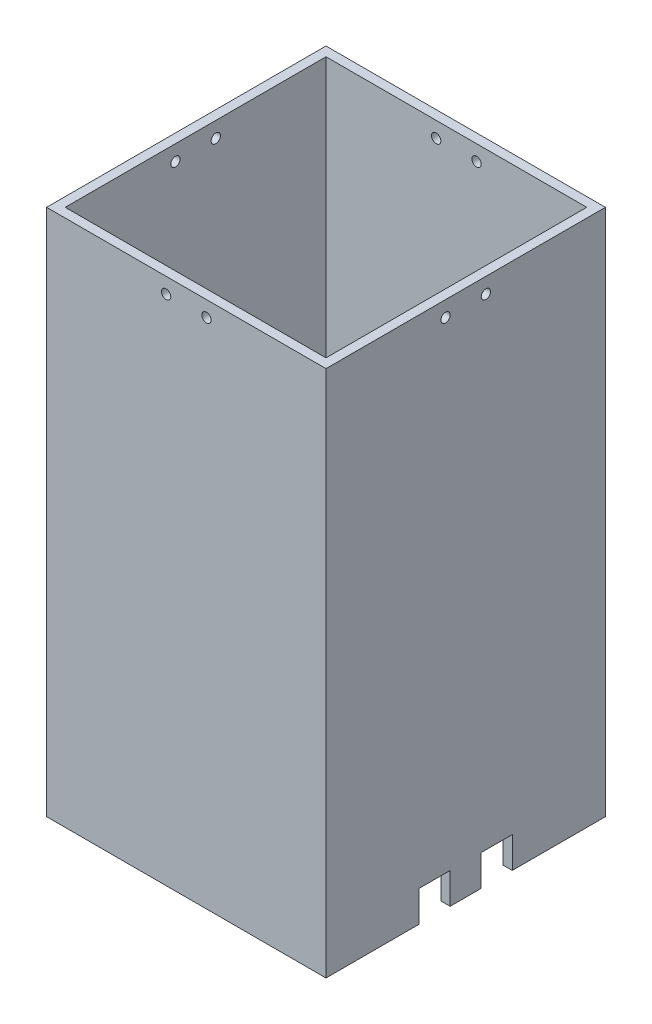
ISO-10303-21;
HEADER;
FILE_DESCRIPTION(('STEP AP214'),'2;1');
FILE_NAME('part.step','',(''),(''),'','','');
FILE_SCHEMA(('AUTOMOTIVE_DESIGN { 1 0 10303 214 1 1 1 1 }'));
ENDSEC;
DATA;
#1=APPLICATION_CONTEXT('core data for automotive mechanical design processes');
#2=APPLICATION_PROTOCOL_DEFINITION('international standard','automotive_design',2000,#1);
#3=PRODUCT_CONTEXT('',#1,'mechanical');
#4=PRODUCT('Part','Part','',(#3));
#5=PRODUCT_RELATED_PRODUCT_CATEGORY('part','',(#4));
#6=PRODUCT_DEFINITION_FORMATION('','',#4);
#7=PRODUCT_DEFINITION_CONTEXT('part definition',#1,'design');
#8=PRODUCT_DEFINITION('design','',#6,#7);
#9=PRODUCT_DEFINITION_SHAPE('','',#8);
#10=(LENGTH_UNIT() NAMED_UNIT(*) SI_UNIT(.MILLI.,.METRE.));
#11=(NAMED_UNIT(*) PLANE_ANGLE_UNIT() SI_UNIT($,.RADIAN.));
#12=(NAMED_UNIT(*) SI_UNIT($,.STERADIAN.) SOLID_ANGLE_UNIT());
#13=UNCERTAINTY_MEASURE_WITH_UNIT(LENGTH_MEASURE(1.E-05),#10,'distance_accuracy_value','');
#14=(GEOMETRIC_REPRESENTATION_CONTEXT(3) GLOBAL_UNCERTAINTY_ASSIGNED_CONTEXT((#13)) GLOBAL_UNIT_ASSIGNED_CONTEXT((#10,
#11,#12)) REPRESENTATION_CONTEXT('',''));
#15=CARTESIAN_POINT('',(0.,0.,0.));
#16=DIRECTION('',(0.,0.,1.));
#17=DIRECTION('',(1.,0.,0.));
#18=AXIS2_PLACEMENT_3D('',#15,#16,#17);
#19=CARTESIAN_POINT('',(0.,0.,0.));
#20=DIRECTION('',(0.,-1.,0.));
#21=DIRECTION('',(0.,0.,-1.));
#22=AXIS2_PLACEMENT_3D('',#19,#20,#21);
#23=PLANE('',#22);
#24=DIRECTION('',(1.,0.,0.));
#25=VECTOR('',#24,1.);
#26=CARTESIAN_POINT('',(-59.1421356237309,0.,15.));
#27=LINE('',#26,#25);
#28=CARTESIAN_POINT('',(42.,0.,15.));
#29=VERTEX_POINT('',#28);
#30=CARTESIAN_POINT('',(45.,0.,15.));
#31=VERTEX_POINT('',#30);
#32=EDGE_CURVE('E195',#29,#31,#27,.T.);
#33=ORIENTED_EDGE('',*,*,#32,.T.);
#34=DIRECTION('',(0.,0.,-1.));
#35=VECTOR('',#34,1.);
#36=CARTESIAN_POINT('',(45.,0.,45.));
#37=LINE('',#36,#35);
#38=CARTESIAN_POINT('',(45.,0.,45.));
#39=VERTEX_POINT('',#38);
#40=EDGE_CURVE('E209',#39,#31,#37,.T.);
#41=ORIENTED_EDGE('',*,*,#40,.F.);
#42=DIRECTION('',(1.,0.,0.));
#43=VECTOR('',#42,1.);
#44=CARTESIAN_POINT('',(-45.,0.,45.));
#45=LINE('',#44,#43);
#46=CARTESIAN_POINT('',(-45.,0.,45.));
#47=VERTEX_POINT('',#46);
#48=EDGE_CURVE('E248',#47,#39,#45,.T.);
#49=ORIENTED_EDGE('',*,*,#48,.F.);
#50=DIRECTION('',(0.,0.,1.));
#51=VECTOR('',#50,1.);
#52=CARTESIAN_POINT('',(-45.,0.,45.));
#53=LINE('',#52,#51);
#54=CARTESIAN_POINT('',(-45.,0.,15.));
#55=VERTEX_POINT('',#54);
#56=EDGE_CURVE('E224',#55,#47,#53,.T.);
#57=ORIENTED_EDGE('',*,*,#56,.F.);
#58=CARTESIAN_POINT('',(-42.,0.,15.));
#59=VERTEX_POINT('',#58);
#60=EDGE_CURVE('E213',#55,#59,#27,.T.);
#61=ORIENTED_EDGE('',*,*,#60,.T.);
#62=DIRECTION('',(0.,0.,1.));
#63=VECTOR('',#62,1.);
#64=CARTESIAN_POINT('',(-42.,0.,-42.));
#65=LINE('',#64,#63);
#66=CARTESIAN_POINT('',(-42.,0.,42.));
#67=VERTEX_POINT('',#66);
#68=EDGE_CURVE('E403',#59,#67,#65,.T.);
#69=ORIENTED_EDGE('',*,*,#68,.T.);
#70=DIRECTION('',(1.,0.,0.));
#71=VECTOR('',#70,1.);
#72=CARTESIAN_POINT('',(-42.,0.,42.));
#73=LINE('',#72,#71);
#74=CARTESIAN_POINT('',(42.,0.,42.));
#75=VERTEX_POINT('',#74);
#76=EDGE_CURVE('E407',#67,#75,#73,.T.);
#77=ORIENTED_EDGE('',*,*,#76,.T.);
#78=DIRECTION('',(0.,0.,-1.));
#79=VECTOR('',#78,1.);
#80=CARTESIAN_POINT('',(42.,0.,42.));
#81=LINE('',#80,#79);
#82=EDGE_CURVE('E212',#75,#29,#81,.T.);
#83=ORIENTED_EDGE('',*,*,#82,.T.);
#84=EDGE_LOOP('',(#33,#41,#49,#57,#61,#69,#77,#83));
#85=FACE_BOUND('',#84,.T.);
#86=ADVANCED_FACE('F33',(#85),#23,.T.);
#87=DIRECTION('',(1.,0.,0.));
#88=VECTOR('',#87,1.);
#89=CARTESIAN_POINT('',(-59.1421356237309,0.,5.00000000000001));
#90=LINE('',#89,#88);
#91=CARTESIAN_POINT('',(-45.,0.,5.00000000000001));
#92=VERTEX_POINT('',#91);
#93=CARTESIAN_POINT('',(-42.,0.,5.00000000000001));
#94=VERTEX_POINT('',#93);
#95=EDGE_CURVE('E48',#92,#94,#90,.T.);
#96=ORIENTED_EDGE('',*,*,#95,.F.);
#97=CARTESIAN_POINT('',(-45.,0.,-5.));
#98=VERTEX_POINT('',#97);
#99=EDGE_CURVE('E471',#98,#92,#53,.T.);
#100=ORIENTED_EDGE('',*,*,#99,.F.);
#101=DIRECTION('',(1.,0.,0.));
#102=VECTOR('',#101,1.);
#103=CARTESIAN_POINT('',(-59.1421356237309,0.,-5.));
#104=LINE('',#103,#102);
#105=CARTESIAN_POINT('',(-42.,0.,-5.));
#106=VERTEX_POINT('',#105);
#107=EDGE_CURVE('E355',#98,#106,#104,.T.);
#108=ORIENTED_EDGE('',*,*,#107,.T.);
#109=EDGE_CURVE('E408',#106,#94,#65,.T.);
#110=ORIENTED_EDGE('',*,*,#109,.T.);
#111=EDGE_LOOP('',(#96,#100,#108,#110));
#112=FACE_BOUND('',#111,.T.);
#113=ADVANCED_FACE('F498',(#112),#23,.T.);
#114=CARTESIAN_POINT('',(42.,0.,5.00000000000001));
#115=VERTEX_POINT('',#114);
#116=CARTESIAN_POINT('',(45.,0.,5.00000000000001));
#117=VERTEX_POINT('',#116);
#118=EDGE_CURVE('E307',#115,#117,#90,.T.);
#119=ORIENTED_EDGE('',*,*,#118,.F.);
#120=CARTESIAN_POINT('',(42.,0.,-5.));
#121=VERTEX_POINT('',#120);
#122=EDGE_CURVE('E304',#115,#121,#81,.T.);
#123=ORIENTED_EDGE('',*,*,#122,.T.);
#124=CARTESIAN_POINT('',(45.,0.,-5.));
#125=VERTEX_POINT('',#124);
#126=EDGE_CURVE('E344',#121,#125,#104,.T.);
#127=ORIENTED_EDGE('',*,*,#126,.T.);
#128=EDGE_CURVE('E221',#117,#125,#37,.T.);
#129=ORIENTED_EDGE('',*,*,#128,.F.);
#130=EDGE_LOOP('',(#119,#123,#127,#129));
#131=FACE_BOUND('',#130,.T.);
#132=ADVANCED_FACE('F311',(#131),#23,.T.);
#133=CARTESIAN_POINT('',(0.,170.,0.));
#134=DIRECTION('',(0.,-1.,0.));
#135=DIRECTION('',(0.,0.,-1.));
#136=AXIS2_PLACEMENT_3D('',#133,#134,#135);
#137=PLANE('',#136);
#138=DIRECTION('',(0.,0.,-1.));
#139=VECTOR('',#138,1.);
#140=CARTESIAN_POINT('',(45.,170.,45.));
#141=LINE('',#140,#139);
#142=CARTESIAN_POINT('',(45.,170.,45.));
#143=VERTEX_POINT('',#142);
#144=CARTESIAN_POINT('',(45.,170.,-45.));
#145=VERTEX_POINT('',#144);
#146=EDGE_CURVE('E244',#143,#145,#141,.T.);
#147=ORIENTED_EDGE('',*,*,#146,.T.);
#148=DIRECTION('',(-1.,0.,0.));
#149=VECTOR('',#148,1.);
#150=CARTESIAN_POINT('',(-45.,170.,-45.));
#151=LINE('',#150,#149);
#152=CARTESIAN_POINT('',(-45.,170.,-45.));
#153=VERTEX_POINT('',#152);
#154=EDGE_CURVE('E247',#145,#153,#151,.T.);
#155=ORIENTED_EDGE('',*,*,#154,.T.);
#156=DIRECTION('',(0.,0.,1.));
#157=VECTOR('',#156,1.);
#158=CARTESIAN_POINT('',(-45.,170.,45.));
#159=LINE('',#158,#157);
#160=CARTESIAN_POINT('',(-45.,170.,45.));
#161=VERTEX_POINT('',#160);
#162=EDGE_CURVE('E250',#153,#161,#159,.T.);
#163=ORIENTED_EDGE('',*,*,#162,.T.);
#164=DIRECTION('',(1.,0.,0.));
#165=VECTOR('',#164,1.);
#166=CARTESIAN_POINT('',(-45.,170.,45.));
#167=LINE('',#166,#165);
#168=EDGE_CURVE('E251',#161,#143,#167,.T.);
#169=ORIENTED_EDGE('',*,*,#168,.T.);
#170=EDGE_LOOP('',(#147,#155,#163,#169));
#171=FACE_BOUND('',#170,.T.);
#172=DIRECTION('',(-1.,0.,0.));
#173=VECTOR('',#172,1.);
#174=CARTESIAN_POINT('',(42.,170.,-42.));
#175=LINE('',#174,#173);
#176=CARTESIAN_POINT('',(42.,170.,-42.));
#177=VERTEX_POINT('',#176);
#178=CARTESIAN_POINT('',(-42.,170.,-42.));
#179=VERTEX_POINT('',#178);
#180=EDGE_CURVE('E392',#177,#179,#175,.T.);
#181=ORIENTED_EDGE('',*,*,#180,.F.);
#182=DIRECTION('',(0.,0.,-1.));
#183=VECTOR('',#182,1.);
#184=CARTESIAN_POINT('',(42.,170.,42.));
#185=LINE('',#184,#183);
#186=CARTESIAN_POINT('',(42.,170.,42.));
#187=VERTEX_POINT('',#186);
#188=EDGE_CURVE('E399',#187,#177,#185,.T.);
#189=ORIENTED_EDGE('',*,*,#188,.F.);
#190=DIRECTION('',(1.,0.,0.));
#191=VECTOR('',#190,1.);
#192=CARTESIAN_POINT('',(-42.,170.,42.));
#193=LINE('',#192,#191);
#194=CARTESIAN_POINT('',(-42.,170.,42.));
#195=VERTEX_POINT('',#194);
#196=EDGE_CURVE('E396',#195,#187,#193,.T.);
#197=ORIENTED_EDGE('',*,*,#196,.F.);
#198=DIRECTION('',(0.,0.,1.));
#199=VECTOR('',#198,1.);
#200=CARTESIAN_POINT('',(-42.,170.,-42.));
#201=LINE('',#200,#199);
#202=EDGE_CURVE('E394',#179,#195,#201,.T.);
#203=ORIENTED_EDGE('',*,*,#202,.F.);
#204=EDGE_LOOP('',(#181,#189,#197,#203));
#205=FACE_BOUND('',#204,.T.);
#206=ADVANCED_FACE('F428',(#171,#205),#137,.F.);
#207=DIRECTION('',(1.,0.,0.));
#208=VECTOR('',#207,1.);
#209=CARTESIAN_POINT('',(-59.1421356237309,0.,-15.));
#210=LINE('',#209,#208);
#211=CARTESIAN_POINT('',(-45.,0.,-15.));
#212=VERTEX_POINT('',#211);
#213=CARTESIAN_POINT('',(-42.,0.,-15.));
#214=VERTEX_POINT('',#213);
#215=EDGE_CURVE('E352',#212,#214,#210,.T.);
#216=ORIENTED_EDGE('',*,*,#215,.F.);
#217=CARTESIAN_POINT('',(-45.,0.,-45.));
#218=VERTEX_POINT('',#217);
#219=EDGE_CURVE('E472',#218,#212,#53,.T.);
#220=ORIENTED_EDGE('',*,*,#219,.F.);
#221=DIRECTION('',(-1.,0.,0.));
#222=VECTOR('',#221,1.);
#223=CARTESIAN_POINT('',(-45.,0.,-45.));
#224=LINE('',#223,#222);
#225=CARTESIAN_POINT('',(45.,0.,-45.));
#226=VERTEX_POINT('',#225);
#227=EDGE_CURVE('E220',#226,#218,#224,.T.);
#228=ORIENTED_EDGE('',*,*,#227,.F.);
#229=CARTESIAN_POINT('',(45.,0.,-15.));
#230=VERTEX_POINT('',#229);
#231=EDGE_CURVE('E223',#230,#226,#37,.T.);
#232=ORIENTED_EDGE('',*,*,#231,.F.);
#233=CARTESIAN_POINT('',(42.,0.,-15.));
#234=VERTEX_POINT('',#233);
#235=EDGE_CURVE('E354',#234,#230,#210,.T.);
#236=ORIENTED_EDGE('',*,*,#235,.F.);
#237=CARTESIAN_POINT('',(42.,0.,-42.));
#238=VERTEX_POINT('',#237);
#239=EDGE_CURVE('E410',#234,#238,#81,.T.);
#240=ORIENTED_EDGE('',*,*,#239,.T.);
#241=DIRECTION('',(-1.,0.,0.));
#242=VECTOR('',#241,1.);
#243=CARTESIAN_POINT('',(42.,0.,-42.));
#244=LINE('',#243,#242);
#245=CARTESIAN_POINT('',(-42.,0.,-42.));
#246=VERTEX_POINT('',#245);
#247=EDGE_CURVE('E391',#238,#246,#244,.T.);
#248=ORIENTED_EDGE('',*,*,#247,.T.);
#249=EDGE_CURVE('E404',#246,#214,#65,.T.);
#250=ORIENTED_EDGE('',*,*,#249,.T.);
#251=EDGE_LOOP('',(#216,#220,#228,#232,#236,#240,#248,#250));
#252=FACE_BOUND('',#251,.T.);
#253=ADVANCED_FACE('F434',(#252),#23,.T.);
#254=CARTESIAN_POINT('',(45.,170.,45.));
#255=DIRECTION('',(-1.,0.,0.));
#256=DIRECTION('',(0.,0.,1.));
#257=AXIS2_PLACEMENT_3D('',#254,#255,#256);
#258=PLANE('',#257);
#259=CARTESIAN_POINT('',(45.,165.,6.49999999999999));
#260=DIRECTION('',(1.,0.,0.));
#261=DIRECTION('',(0.,0.,-1.));
#262=AXIS2_PLACEMENT_3D('',#259,#260,#261);
#263=CIRCLE('',#262,1.5);
#264=CARTESIAN_POINT('',(45.,165.,4.99999999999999));
#265=VERTEX_POINT('',#264);
#266=EDGE_CURVE('E363',#265,#265,#263,.T.);
#267=ORIENTED_EDGE('',*,*,#266,.F.);
#268=EDGE_LOOP('',(#267));
#269=FACE_BOUND('',#268,.T.);
#270=CARTESIAN_POINT('',(45.,165.,-6.50000000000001));
#271=DIRECTION('',(1.,0.,0.));
#272=DIRECTION('',(0.,0.,-1.));
#273=AXIS2_PLACEMENT_3D('',#270,#271,#272);
#274=CIRCLE('',#273,1.5);
#275=CARTESIAN_POINT('',(45.,165.,-8.00000000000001));
#276=VERTEX_POINT('',#275);
#277=EDGE_CURVE('E370',#276,#276,#274,.T.);
#278=ORIENTED_EDGE('',*,*,#277,.F.);
#279=EDGE_LOOP('',(#278));
#280=FACE_BOUND('',#279,.T.);
#281=ORIENTED_EDGE('',*,*,#40,.T.);
#282=DIRECTION('',(0.,-1.,0.));
#283=VECTOR('',#282,1.);
#284=CARTESIAN_POINT('',(45.,0.,15.));
#285=LINE('',#284,#283);
#286=CARTESIAN_POINT('',(45.,10.,15.));
#287=VERTEX_POINT('',#286);
#288=EDGE_CURVE('E192',#287,#31,#285,.T.);
#289=ORIENTED_EDGE('',*,*,#288,.F.);
#290=DIRECTION('',(0.,0.,1.));
#291=VECTOR('',#290,1.);
#292=CARTESIAN_POINT('',(45.,10.,15.));
#293=LINE('',#292,#291);
#294=CARTESIAN_POINT('',(45.,10.,5.00000000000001));
#295=VERTEX_POINT('',#294);
#296=EDGE_CURVE('E214',#295,#287,#293,.T.);
#297=ORIENTED_EDGE('',*,*,#296,.F.);
#298=DIRECTION('',(0.,1.,0.));
#299=VECTOR('',#298,1.);
#300=CARTESIAN_POINT('',(45.,0.,5.00000000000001));
#301=LINE('',#300,#299);
#302=EDGE_CURVE('E203',#117,#295,#301,.T.);
#303=ORIENTED_EDGE('',*,*,#302,.F.);
#304=ORIENTED_EDGE('',*,*,#128,.T.);
#305=DIRECTION('',(0.,-1.,0.));
#306=VECTOR('',#305,1.);
#307=CARTESIAN_POINT('',(45.,0.,-5.));
#308=LINE('',#307,#306);
#309=CARTESIAN_POINT('',(45.,10.,-5.));
#310=VERTEX_POINT('',#309);
#311=EDGE_CURVE('E327',#310,#125,#308,.T.);
#312=ORIENTED_EDGE('',*,*,#311,.F.);
#313=DIRECTION('',(0.,0.,1.));
#314=VECTOR('',#313,1.);
#315=CARTESIAN_POINT('',(45.,10.,-5.));
#316=LINE('',#315,#314);
#317=CARTESIAN_POINT('',(45.,10.,-15.));
#318=VERTEX_POINT('',#317);
#319=EDGE_CURVE('E341',#318,#310,#316,.T.);
#320=ORIENTED_EDGE('',*,*,#319,.F.);
#321=DIRECTION('',(0.,1.,0.));
#322=VECTOR('',#321,1.);
#323=CARTESIAN_POINT('',(45.,0.,-15.));
#324=LINE('',#323,#322);
#325=EDGE_CURVE('E338',#230,#318,#324,.T.);
#326=ORIENTED_EDGE('',*,*,#325,.F.);
#327=ORIENTED_EDGE('',*,*,#231,.T.);
#328=DIRECTION('',(0.,-1.,0.));
#329=VECTOR('',#328,1.);
#330=CARTESIAN_POINT('',(45.,170.,-45.));
#331=LINE('',#330,#329);
#332=EDGE_CURVE('E264',#145,#226,#331,.T.);
#333=ORIENTED_EDGE('',*,*,#332,.F.);
#334=ORIENTED_EDGE('',*,*,#146,.F.);
#335=DIRECTION('',(0.,-1.,0.));
#336=VECTOR('',#335,1.);
#337=CARTESIAN_POINT('',(45.,170.,45.));
#338=LINE('',#337,#336);
#339=EDGE_CURVE('E219',#143,#39,#338,.T.);
#340=ORIENTED_EDGE('',*,*,#339,.T.);
#341=EDGE_LOOP('',(#281,#289,#297,#303,#304,#312,#320,#326,#327,#333,#334,#340));
#342=FACE_BOUND('',#341,.T.);
#343=ADVANCED_FACE('F35',(#269,#280,#342),#258,.F.);
#344=CARTESIAN_POINT('',(-45.,170.,-45.));
#345=DIRECTION('',(0.,0.,1.));
#346=DIRECTION('',(1.,0.,0.));
#347=AXIS2_PLACEMENT_3D('',#344,#345,#346);
#348=PLANE('',#347);
#349=CARTESIAN_POINT('',(-6.49999999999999,165.,-45.));
#350=DIRECTION('',(0.,0.,1.));
#351=DIRECTION('',(1.,0.,0.));
#352=AXIS2_PLACEMENT_3D('',#349,#350,#351);
#353=CIRCLE('',#352,1.50000000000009);
#354=CARTESIAN_POINT('',(-4.9999999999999,165.,-45.));
#355=VERTEX_POINT('',#354);
#356=EDGE_CURVE('E277',#355,#355,#353,.F.);
#357=ORIENTED_EDGE('',*,*,#356,.F.);
#358=EDGE_LOOP('',(#357));
#359=FACE_BOUND('',#358,.T.);
#360=CARTESIAN_POINT('',(6.50000000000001,165.,-45.));
#361=DIRECTION('',(0.,0.,1.));
#362=DIRECTION('',(1.,0.,0.));
#363=AXIS2_PLACEMENT_3D('',#360,#361,#362);
#364=CIRCLE('',#363,1.50000000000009);
#365=CARTESIAN_POINT('',(8.00000000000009,165.,-45.));
#366=VERTEX_POINT('',#365);
#367=EDGE_CURVE('E272',#366,#366,#364,.F.);
#368=ORIENTED_EDGE('',*,*,#367,.F.);
#369=EDGE_LOOP('',(#368));
#370=FACE_BOUND('',#369,.T.);
#371=ORIENTED_EDGE('',*,*,#227,.T.);
#372=DIRECTION('',(0.,-1.,0.));
#373=VECTOR('',#372,1.);
#374=CARTESIAN_POINT('',(-45.,170.,-45.));
#375=LINE('',#374,#373);
#376=EDGE_CURVE('E257',#153,#218,#375,.T.);
#377=ORIENTED_EDGE('',*,*,#376,.F.);
#378=ORIENTED_EDGE('',*,*,#154,.F.);
#379=ORIENTED_EDGE('',*,*,#332,.T.);
#380=EDGE_LOOP('',(#371,#377,#378,#379));
#381=FACE_BOUND('',#380,.T.);
#382=ADVANCED_FACE('F482',(#359,#370,#381),#348,.F.);
#383=CARTESIAN_POINT('',(-45.,170.,45.));
#384=DIRECTION('',(1.,0.,0.));
#385=DIRECTION('',(0.,0.,-1.));
#386=AXIS2_PLACEMENT_3D('',#383,#384,#385);
#387=PLANE('',#386);
#388=CARTESIAN_POINT('',(-45.,165.,6.49999999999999));
#389=DIRECTION('',(1.,0.,0.));
#390=DIRECTION('',(0.,0.,-1.));
#391=AXIS2_PLACEMENT_3D('',#388,#389,#390);
#392=CIRCLE('',#391,1.5);
#393=CARTESIAN_POINT('',(-45.,165.,4.99999999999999));
#394=VERTEX_POINT('',#393);
#395=EDGE_CURVE('E287',#394,#394,#392,.F.);
#396=ORIENTED_EDGE('',*,*,#395,.F.);
#397=EDGE_LOOP('',(#396));
#398=FACE_BOUND('',#397,.T.);
#399=CARTESIAN_POINT('',(-45.,165.,-6.50000000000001));
#400=DIRECTION('',(1.,0.,0.));
#401=DIRECTION('',(0.,0.,-1.));
#402=AXIS2_PLACEMENT_3D('',#399,#400,#401);
#403=CIRCLE('',#402,1.5);
#404=CARTESIAN_POINT('',(-45.,165.,-8.00000000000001));
#405=VERTEX_POINT('',#404);
#406=EDGE_CURVE('E282',#405,#405,#403,.F.);
#407=ORIENTED_EDGE('',*,*,#406,.F.);
#408=EDGE_LOOP('',(#407));
#409=FACE_BOUND('',#408,.T.);
#410=DIRECTION('',(0.,0.,-1.));
#411=VECTOR('',#410,1.);
#412=CARTESIAN_POINT('',(-45.,10.,15.));
#413=LINE('',#412,#411);
#414=CARTESIAN_POINT('',(-45.,10.,15.));
#415=VERTEX_POINT('',#414);
#416=CARTESIAN_POINT('',(-45.,10.,5.00000000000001));
#417=VERTEX_POINT('',#416);
#418=EDGE_CURVE('E455',#415,#417,#413,.T.);
#419=ORIENTED_EDGE('',*,*,#418,.F.);
#420=DIRECTION('',(0.,1.,0.));
#421=VECTOR('',#420,1.);
#422=CARTESIAN_POINT('',(-45.,0.,15.));
#423=LINE('',#422,#421);
#424=EDGE_CURVE('E323',#55,#415,#423,.T.);
#425=ORIENTED_EDGE('',*,*,#424,.F.);
#426=ORIENTED_EDGE('',*,*,#56,.T.);
#427=DIRECTION('',(0.,-1.,0.));
#428=VECTOR('',#427,1.);
#429=CARTESIAN_POINT('',(-45.,170.,45.));
#430=LINE('',#429,#428);
#431=EDGE_CURVE('E254',#161,#47,#430,.T.);
#432=ORIENTED_EDGE('',*,*,#431,.F.);
#433=ORIENTED_EDGE('',*,*,#162,.F.);
#434=ORIENTED_EDGE('',*,*,#376,.T.);
#435=ORIENTED_EDGE('',*,*,#219,.T.);
#436=DIRECTION('',(0.,-1.,0.));
#437=VECTOR('',#436,1.);
#438=CARTESIAN_POINT('',(-45.,0.,-15.));
#439=LINE('',#438,#437);
#440=CARTESIAN_POINT('',(-45.,10.,-15.));
#441=VERTEX_POINT('',#440);
#442=EDGE_CURVE('E328',#441,#212,#439,.T.);
#443=ORIENTED_EDGE('',*,*,#442,.F.);
#444=DIRECTION('',(0.,0.,-1.));
#445=VECTOR('',#444,1.);
#446=CARTESIAN_POINT('',(-45.,10.,-5.));
#447=LINE('',#446,#445);
#448=CARTESIAN_POINT('',(-45.,10.,-5.));
#449=VERTEX_POINT('',#448);
#450=EDGE_CURVE('E330',#449,#441,#447,.T.);
#451=ORIENTED_EDGE('',*,*,#450,.F.);
#452=DIRECTION('',(0.,1.,0.));
#453=VECTOR('',#452,1.);
#454=CARTESIAN_POINT('',(-45.,0.,-5.));
#455=LINE('',#454,#453);
#456=EDGE_CURVE('E333',#98,#449,#455,.T.);
#457=ORIENTED_EDGE('',*,*,#456,.F.);
#458=ORIENTED_EDGE('',*,*,#99,.T.);
#459=DIRECTION('',(0.,-1.,0.));
#460=VECTOR('',#459,1.);
#461=CARTESIAN_POINT('',(-45.,0.,5.00000000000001));
#462=LINE('',#461,#460);
#463=EDGE_CURVE('E452',#417,#92,#462,.T.);
#464=ORIENTED_EDGE('',*,*,#463,.F.);
#465=EDGE_LOOP('',(#419,#425,#426,#432,#433,#434,#435,#443,#451,#457,#458,#464));
#466=FACE_BOUND('',#465,.T.);
#467=ADVANCED_FACE('F469',(#398,#409,#466),#387,.F.);
#468=CARTESIAN_POINT('',(-45.,170.,45.));
#469=DIRECTION('',(0.,0.,-1.));
#470=DIRECTION('',(-1.,0.,0.));
#471=AXIS2_PLACEMENT_3D('',#468,#469,#470);
#472=PLANE('',#471);
#473=CARTESIAN_POINT('',(-6.49999999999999,165.,45.));
#474=DIRECTION('',(0.,0.,1.));
#475=DIRECTION('',(1.,0.,0.));
#476=AXIS2_PLACEMENT_3D('',#473,#474,#475);
#477=CIRCLE('',#476,1.50000000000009);
#478=CARTESIAN_POINT('',(-4.9999999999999,165.,45.));
#479=VERTEX_POINT('',#478);
#480=EDGE_CURVE('E377',#479,#479,#477,.T.);
#481=ORIENTED_EDGE('',*,*,#480,.F.);
#482=EDGE_LOOP('',(#481));
#483=FACE_BOUND('',#482,.T.);
#484=CARTESIAN_POINT('',(6.50000000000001,165.,45.));
#485=DIRECTION('',(0.,0.,1.));
#486=DIRECTION('',(1.,0.,0.));
#487=AXIS2_PLACEMENT_3D('',#484,#485,#486);
#488=CIRCLE('',#487,1.50000000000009);
#489=CARTESIAN_POINT('',(8.00000000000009,165.,45.));
#490=VERTEX_POINT('',#489);
#491=EDGE_CURVE('E384',#490,#490,#488,.T.);
#492=ORIENTED_EDGE('',*,*,#491,.F.);
#493=EDGE_LOOP('',(#492));
#494=FACE_BOUND('',#493,.T.);
#495=ORIENTED_EDGE('',*,*,#48,.T.);
#496=ORIENTED_EDGE('',*,*,#339,.F.);
#497=ORIENTED_EDGE('',*,*,#168,.F.);
#498=ORIENTED_EDGE('',*,*,#431,.T.);
#499=EDGE_LOOP('',(#495,#496,#497,#498));
#500=FACE_BOUND('',#499,.T.);
#501=ADVANCED_FACE('F478',(#483,#494,#500),#472,.F.);
#502=CARTESIAN_POINT('',(42.,170.,-42.));
#503=DIRECTION('',(0.,0.,1.));
#504=DIRECTION('',(1.,0.,0.));
#505=AXIS2_PLACEMENT_3D('',#502,#503,#504);
#506=PLANE('',#505);
#507=CARTESIAN_POINT('',(-6.49999999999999,165.,-42.));
#508=DIRECTION('',(0.,0.,1.));
#509=DIRECTION('',(1.,0.,0.));
#510=AXIS2_PLACEMENT_3D('',#507,#508,#509);
#511=CIRCLE('',#510,1.50000000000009);
#512=CARTESIAN_POINT('',(-4.9999999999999,165.,-42.));
#513=VERTEX_POINT('',#512);
#514=EDGE_CURVE('E276',#513,#513,#511,.T.);
#515=ORIENTED_EDGE('',*,*,#514,.F.);
#516=EDGE_LOOP('',(#515));
#517=FACE_BOUND('',#516,.T.);
#518=CARTESIAN_POINT('',(6.50000000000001,165.,-42.));
#519=DIRECTION('',(0.,0.,1.));
#520=DIRECTION('',(1.,0.,0.));
#521=AXIS2_PLACEMENT_3D('',#518,#519,#520);
#522=CIRCLE('',#521,1.50000000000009);
#523=CARTESIAN_POINT('',(8.00000000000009,165.,-42.));
#524=VERTEX_POINT('',#523);
#525=EDGE_CURVE('E271',#524,#524,#522,.T.);
#526=ORIENTED_EDGE('',*,*,#525,.F.);
#527=EDGE_LOOP('',(#526));
#528=FACE_BOUND('',#527,.T.);
#529=ORIENTED_EDGE('',*,*,#247,.F.);
#530=DIRECTION('',(0.,-1.,0.));
#531=VECTOR('',#530,1.);
#532=CARTESIAN_POINT('',(42.,170.,-42.));
#533=LINE('',#532,#531);
#534=EDGE_CURVE('E401',#177,#238,#533,.T.);
#535=ORIENTED_EDGE('',*,*,#534,.F.);
#536=ORIENTED_EDGE('',*,*,#180,.T.);
#537=DIRECTION('',(0.,-1.,0.));
#538=VECTOR('',#537,1.);
#539=CARTESIAN_POINT('',(-42.,170.,-42.));
#540=LINE('',#539,#538);
#541=EDGE_CURVE('E227',#179,#246,#540,.T.);
#542=ORIENTED_EDGE('',*,*,#541,.T.);
#543=EDGE_LOOP('',(#529,#535,#536,#542));
#544=FACE_BOUND('',#543,.T.);
#545=ADVANCED_FACE('F431',(#517,#528,#544),#506,.T.);
#546=CARTESIAN_POINT('',(-42.,170.,-42.));
#547=DIRECTION('',(1.,0.,0.));
#548=DIRECTION('',(0.,0.,-1.));
#549=AXIS2_PLACEMENT_3D('',#546,#547,#548);
#550=PLANE('',#549);
#551=DIRECTION('',(0.,-1.,0.));
#552=VECTOR('',#551,1.);
#553=CARTESIAN_POINT('',(-42.,170.,15.));
#554=LINE('',#553,#552);
#555=CARTESIAN_POINT('',(-42.,10.,15.));
#556=VERTEX_POINT('',#555);
#557=EDGE_CURVE('E325',#556,#59,#554,.T.);
#558=ORIENTED_EDGE('',*,*,#557,.F.);
#559=DIRECTION('',(0.,0.,1.));
#560=VECTOR('',#559,1.);
#561=CARTESIAN_POINT('',(-42.,10.,-42.));
#562=LINE('',#561,#560);
#563=CARTESIAN_POINT('',(-42.,10.,5.00000000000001));
#564=VERTEX_POINT('',#563);
#565=EDGE_CURVE('E322',#564,#556,#562,.T.);
#566=ORIENTED_EDGE('',*,*,#565,.F.);
#567=DIRECTION('',(0.,1.,0.));
#568=VECTOR('',#567,1.);
#569=CARTESIAN_POINT('',(-42.,170.,5.00000000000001));
#570=LINE('',#569,#568);
#571=EDGE_CURVE('E320',#94,#564,#570,.T.);
#572=ORIENTED_EDGE('',*,*,#571,.F.);
#573=ORIENTED_EDGE('',*,*,#109,.F.);
#574=DIRECTION('',(0.,-1.,0.));
#575=VECTOR('',#574,1.);
#576=CARTESIAN_POINT('',(-42.,170.,-5.));
#577=LINE('',#576,#575);
#578=CARTESIAN_POINT('',(-42.,10.,-5.));
#579=VERTEX_POINT('',#578);
#580=EDGE_CURVE('E361',#579,#106,#577,.T.);
#581=ORIENTED_EDGE('',*,*,#580,.F.);
#582=DIRECTION('',(0.,0.,1.));
#583=VECTOR('',#582,1.);
#584=CARTESIAN_POINT('',(-42.,10.,-42.));
#585=LINE('',#584,#583);
#586=CARTESIAN_POINT('',(-42.,10.,-15.));
#587=VERTEX_POINT('',#586);
#588=EDGE_CURVE('E359',#587,#579,#585,.T.);
#589=ORIENTED_EDGE('',*,*,#588,.F.);
#590=DIRECTION('',(0.,1.,0.));
#591=VECTOR('',#590,1.);
#592=CARTESIAN_POINT('',(-42.,170.,-15.));
#593=LINE('',#592,#591);
#594=EDGE_CURVE('E335',#214,#587,#593,.T.);
#595=ORIENTED_EDGE('',*,*,#594,.F.);
#596=ORIENTED_EDGE('',*,*,#249,.F.);
#597=ORIENTED_EDGE('',*,*,#541,.F.);
#598=ORIENTED_EDGE('',*,*,#202,.T.);
#599=DIRECTION('',(0.,-1.,0.));
#600=VECTOR('',#599,1.);
#601=CARTESIAN_POINT('',(-42.,170.,42.));
#602=LINE('',#601,#600);
#603=EDGE_CURVE('E233',#195,#67,#602,.T.);
#604=ORIENTED_EDGE('',*,*,#603,.T.);
#605=ORIENTED_EDGE('',*,*,#68,.F.);
#606=EDGE_LOOP('',(#558,#566,#572,#573,#581,#589,#595,#596,#597,#598,#604,#605));
#607=FACE_BOUND('',#606,.T.);
#608=CARTESIAN_POINT('',(-42.,165.,6.49999999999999));
#609=DIRECTION('',(1.,0.,0.));
#610=DIRECTION('',(0.,0.,-1.));
#611=AXIS2_PLACEMENT_3D('',#608,#609,#610);
#612=CIRCLE('',#611,1.5);
#613=CARTESIAN_POINT('',(-42.,165.,4.99999999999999));
#614=VERTEX_POINT('',#613);
#615=EDGE_CURVE('E286',#614,#614,#612,.T.);
#616=ORIENTED_EDGE('',*,*,#615,.F.);
#617=EDGE_LOOP('',(#616));
#618=FACE_BOUND('',#617,.T.);
#619=CARTESIAN_POINT('',(-42.,165.,-6.50000000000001));
#620=DIRECTION('',(1.,0.,0.));
#621=DIRECTION('',(0.,0.,-1.));
#622=AXIS2_PLACEMENT_3D('',#619,#620,#621);
#623=CIRCLE('',#622,1.5);
#624=CARTESIAN_POINT('',(-42.,165.,-8.00000000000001));
#625=VERTEX_POINT('',#624);
#626=EDGE_CURVE('E281',#625,#625,#623,.T.);
#627=ORIENTED_EDGE('',*,*,#626,.F.);
#628=EDGE_LOOP('',(#627));
#629=FACE_BOUND('',#628,.T.);
#630=ADVANCED_FACE('F423',(#607,#618,#629),#550,.T.);
#631=CARTESIAN_POINT('',(-42.,170.,42.));
#632=DIRECTION('',(0.,0.,-1.));
#633=DIRECTION('',(-1.,0.,0.));
#634=AXIS2_PLACEMENT_3D('',#631,#632,#633);
#635=PLANE('',#634);
#636=CARTESIAN_POINT('',(-6.49999999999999,165.,42.));
#637=DIRECTION('',(0.,0.,-1.));
#638=DIRECTION('',(-1.,0.,0.));
#639=AXIS2_PLACEMENT_3D('',#636,#637,#638);
#640=CIRCLE('',#639,1.50000000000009);
#641=CARTESIAN_POINT('',(-8.00000000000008,165.,42.));
#642=VERTEX_POINT('',#641);
#643=EDGE_CURVE('E273',#642,#642,#640,.T.);
#644=ORIENTED_EDGE('',*,*,#643,.F.);
#645=EDGE_LOOP('',(#644));
#646=FACE_BOUND('',#645,.T.);
#647=CARTESIAN_POINT('',(6.50000000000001,165.,42.));
#648=DIRECTION('',(0.,0.,-1.));
#649=DIRECTION('',(-1.,0.,0.));
#650=AXIS2_PLACEMENT_3D('',#647,#648,#649);
#651=CIRCLE('',#650,1.50000000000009);
#652=CARTESIAN_POINT('',(4.99999999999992,165.,42.));
#653=VERTEX_POINT('',#652);
#654=EDGE_CURVE('E268',#653,#653,#651,.T.);
#655=ORIENTED_EDGE('',*,*,#654,.F.);
#656=EDGE_LOOP('',(#655));
#657=FACE_BOUND('',#656,.T.);
#658=ORIENTED_EDGE('',*,*,#76,.F.);
#659=ORIENTED_EDGE('',*,*,#603,.F.);
#660=ORIENTED_EDGE('',*,*,#196,.T.);
#661=DIRECTION('',(0.,-1.,0.));
#662=VECTOR('',#661,1.);
#663=CARTESIAN_POINT('',(42.,170.,42.));
#664=LINE('',#663,#662);
#665=EDGE_CURVE('E240',#187,#75,#664,.T.);
#666=ORIENTED_EDGE('',*,*,#665,.T.);
#667=EDGE_LOOP('',(#658,#659,#660,#666));
#668=FACE_BOUND('',#667,.T.);
#669=ADVANCED_FACE('F415',(#646,#657,#668),#635,.T.);
#670=CARTESIAN_POINT('',(42.,170.,42.));
#671=DIRECTION('',(-1.,0.,0.));
#672=DIRECTION('',(0.,0.,1.));
#673=AXIS2_PLACEMENT_3D('',#670,#671,#672);
#674=PLANE('',#673);
#675=DIRECTION('',(0.,1.,0.));
#676=VECTOR('',#675,1.);
#677=CARTESIAN_POINT('',(42.,170.,15.));
#678=LINE('',#677,#676);
#679=CARTESIAN_POINT('',(42.,10.,15.));
#680=VERTEX_POINT('',#679);
#681=EDGE_CURVE('E11',#29,#680,#678,.T.);
#682=ORIENTED_EDGE('',*,*,#681,.F.);
#683=ORIENTED_EDGE('',*,*,#82,.F.);
#684=ORIENTED_EDGE('',*,*,#665,.F.);
#685=ORIENTED_EDGE('',*,*,#188,.T.);
#686=ORIENTED_EDGE('',*,*,#534,.T.);
#687=ORIENTED_EDGE('',*,*,#239,.F.);
#688=DIRECTION('',(0.,-1.,0.));
#689=VECTOR('',#688,1.);
#690=CARTESIAN_POINT('',(42.,170.,-15.));
#691=LINE('',#690,#689);
#692=CARTESIAN_POINT('',(42.,10.,-15.));
#693=VERTEX_POINT('',#692);
#694=EDGE_CURVE('E267',#693,#234,#691,.T.);
#695=ORIENTED_EDGE('',*,*,#694,.F.);
#696=DIRECTION('',(0.,0.,-1.));
#697=VECTOR('',#696,1.);
#698=CARTESIAN_POINT('',(42.,10.,42.));
#699=LINE('',#698,#697);
#700=CARTESIAN_POINT('',(42.,10.,-5.));
#701=VERTEX_POINT('',#700);
#702=EDGE_CURVE('E289',#701,#693,#699,.T.);
#703=ORIENTED_EDGE('',*,*,#702,.F.);
#704=DIRECTION('',(0.,1.,0.));
#705=VECTOR('',#704,1.);
#706=CARTESIAN_POINT('',(42.,170.,-5.));
#707=LINE('',#706,#705);
#708=EDGE_CURVE('E292',#121,#701,#707,.T.);
#709=ORIENTED_EDGE('',*,*,#708,.F.);
#710=ORIENTED_EDGE('',*,*,#122,.F.);
#711=DIRECTION('',(0.,-1.,0.));
#712=VECTOR('',#711,1.);
#713=CARTESIAN_POINT('',(42.,170.,5.00000000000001));
#714=LINE('',#713,#712);
#715=CARTESIAN_POINT('',(42.,10.,5.00000000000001));
#716=VERTEX_POINT('',#715);
#717=EDGE_CURVE('E294',#716,#115,#714,.T.);
#718=ORIENTED_EDGE('',*,*,#717,.F.);
#719=DIRECTION('',(0.,0.,-1.));
#720=VECTOR('',#719,1.);
#721=CARTESIAN_POINT('',(42.,10.,42.));
#722=LINE('',#721,#720);
#723=EDGE_CURVE('E41',#680,#716,#722,.T.);
#724=ORIENTED_EDGE('',*,*,#723,.F.);
#725=EDGE_LOOP('',(#682,#683,#684,#685,#686,#687,#695,#703,#709,#710,#718,#724));
#726=FACE_BOUND('',#725,.T.);
#727=CARTESIAN_POINT('',(42.,165.,6.49999999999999));
#728=DIRECTION('',(-1.,0.,0.));
#729=DIRECTION('',(0.,0.,1.));
#730=AXIS2_PLACEMENT_3D('',#727,#728,#729);
#731=CIRCLE('',#730,1.5);
#732=CARTESIAN_POINT('',(42.,165.,7.99999999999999));
#733=VERTEX_POINT('',#732);
#734=EDGE_CURVE('E283',#733,#733,#731,.T.);
#735=ORIENTED_EDGE('',*,*,#734,.F.);
#736=EDGE_LOOP('',(#735));
#737=FACE_BOUND('',#736,.T.);
#738=CARTESIAN_POINT('',(42.,165.,-6.50000000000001));
#739=DIRECTION('',(-1.,0.,0.));
#740=DIRECTION('',(0.,0.,1.));
#741=AXIS2_PLACEMENT_3D('',#738,#739,#740);
#742=CIRCLE('',#741,1.5);
#743=CARTESIAN_POINT('',(42.,165.,-5.));
#744=VERTEX_POINT('',#743);
#745=EDGE_CURVE('E278',#744,#744,#742,.T.);
#746=ORIENTED_EDGE('',*,*,#745,.F.);
#747=EDGE_LOOP('',(#746));
#748=FACE_BOUND('',#747,.T.);
#749=ADVANCED_FACE('F301',(#726,#737,#748),#674,.T.);
#750=CARTESIAN_POINT('',(6.50000000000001,165.,-49.2426406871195));
#751=DIRECTION('',(0.,0.,1.));
#752=DIRECTION('',(1.,0.,0.));
#753=AXIS2_PLACEMENT_3D('',#750,#751,#752);
#754=CYLINDRICAL_SURFACE('',#753,1.50000000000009);
#755=ORIENTED_EDGE('',*,*,#654,.T.);
#756=EDGE_LOOP('',(#755));
#757=FACE_BOUND('',#756,.T.);
#758=ORIENTED_EDGE('',*,*,#491,.T.);
#759=EDGE_LOOP('',(#758));
#760=FACE_BOUND('',#759,.T.);
#761=ADVANCED_FACE('F527',(#757,#760),#754,.F.);
#762=ORIENTED_EDGE('',*,*,#525,.T.);
#763=EDGE_LOOP('',(#762));
#764=FACE_BOUND('',#763,.T.);
#765=ORIENTED_EDGE('',*,*,#367,.T.);
#766=EDGE_LOOP('',(#765));
#767=FACE_BOUND('',#766,.T.);
#768=ADVANCED_FACE('F524',(#764,#767),#754,.F.);
#769=CARTESIAN_POINT('',(-6.49999999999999,165.,-49.2426406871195));
#770=DIRECTION('',(0.,0.,1.));
#771=DIRECTION('',(1.,0.,0.));
#772=AXIS2_PLACEMENT_3D('',#769,#770,#771);
#773=CYLINDRICAL_SURFACE('',#772,1.50000000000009);
#774=ORIENTED_EDGE('',*,*,#643,.T.);
#775=EDGE_LOOP('',(#774));
#776=FACE_BOUND('',#775,.T.);
#777=ORIENTED_EDGE('',*,*,#480,.T.);
#778=EDGE_LOOP('',(#777));
#779=FACE_BOUND('',#778,.T.);
#780=ADVANCED_FACE('F526',(#776,#779),#773,.F.);
#781=ORIENTED_EDGE('',*,*,#514,.T.);
#782=EDGE_LOOP('',(#781));
#783=FACE_BOUND('',#782,.T.);
#784=ORIENTED_EDGE('',*,*,#356,.T.);
#785=EDGE_LOOP('',(#784));
#786=FACE_BOUND('',#785,.T.);
#787=ADVANCED_FACE('F534',(#783,#786),#773,.F.);
#788=CARTESIAN_POINT('',(-49.2426406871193,165.,-6.50000000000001));
#789=DIRECTION('',(1.,0.,0.));
#790=DIRECTION('',(0.,0.,-1.));
#791=AXIS2_PLACEMENT_3D('',#788,#789,#790);
#792=CYLINDRICAL_SURFACE('',#791,1.5);
#793=ORIENTED_EDGE('',*,*,#745,.T.);
#794=EDGE_LOOP('',(#793));
#795=FACE_BOUND('',#794,.T.);
#796=ORIENTED_EDGE('',*,*,#277,.T.);
#797=EDGE_LOOP('',(#796));
#798=FACE_BOUND('',#797,.T.);
#799=ADVANCED_FACE('F556',(#795,#798),#792,.F.);
#800=ORIENTED_EDGE('',*,*,#626,.T.);
#801=EDGE_LOOP('',(#800));
#802=FACE_BOUND('',#801,.T.);
#803=ORIENTED_EDGE('',*,*,#406,.T.);
#804=EDGE_LOOP('',(#803));
#805=FACE_BOUND('',#804,.T.);
#806=ADVANCED_FACE('F560',(#802,#805),#792,.F.);
#807=CARTESIAN_POINT('',(-49.2426406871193,165.,6.49999999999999));
#808=DIRECTION('',(1.,0.,0.));
#809=DIRECTION('',(0.,0.,-1.));
#810=AXIS2_PLACEMENT_3D('',#807,#808,#809);
#811=CYLINDRICAL_SURFACE('',#810,1.5);
#812=ORIENTED_EDGE('',*,*,#734,.T.);
#813=EDGE_LOOP('',(#812));
#814=FACE_BOUND('',#813,.T.);
#815=ORIENTED_EDGE('',*,*,#266,.T.);
#816=EDGE_LOOP('',(#815));
#817=FACE_BOUND('',#816,.T.);
#818=ADVANCED_FACE('F565',(#814,#817),#811,.F.);
#819=ORIENTED_EDGE('',*,*,#615,.T.);
#820=EDGE_LOOP('',(#819));
#821=FACE_BOUND('',#820,.T.);
#822=ORIENTED_EDGE('',*,*,#395,.T.);
#823=EDGE_LOOP('',(#822));
#824=FACE_BOUND('',#823,.T.);
#825=ADVANCED_FACE('F571',(#821,#824),#811,.F.);
#826=CARTESIAN_POINT('',(-59.1421356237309,0.,-15.));
#827=DIRECTION('',(0.,0.,-1.));
#828=DIRECTION('',(-1.,0.,0.));
#829=AXIS2_PLACEMENT_3D('',#826,#827,#828);
#830=PLANE('',#829);
#831=ORIENTED_EDGE('',*,*,#694,.T.);
#832=ORIENTED_EDGE('',*,*,#235,.T.);
#833=ORIENTED_EDGE('',*,*,#325,.T.);
#834=DIRECTION('',(1.,0.,0.));
#835=VECTOR('',#834,1.);
#836=CARTESIAN_POINT('',(-59.1421356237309,10.,-15.));
#837=LINE('',#836,#835);
#838=EDGE_CURVE('E351',#693,#318,#837,.T.);
#839=ORIENTED_EDGE('',*,*,#838,.F.);
#840=EDGE_LOOP('',(#831,#832,#833,#839));
#841=FACE_BOUND('',#840,.T.);
#842=ADVANCED_FACE('F439',(#841),#830,.F.);
#843=CARTESIAN_POINT('',(-59.1421356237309,10.,-5.));
#844=DIRECTION('',(0.,1.,0.));
#845=DIRECTION('',(0.,0.,1.));
#846=AXIS2_PLACEMENT_3D('',#843,#844,#845);
#847=PLANE('',#846);
#848=ORIENTED_EDGE('',*,*,#702,.T.);
#849=ORIENTED_EDGE('',*,*,#838,.T.);
#850=ORIENTED_EDGE('',*,*,#319,.T.);
#851=DIRECTION('',(1.,0.,0.));
#852=VECTOR('',#851,1.);
#853=CARTESIAN_POINT('',(-59.1421356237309,10.,-5.));
#854=LINE('',#853,#852);
#855=EDGE_CURVE('E347',#701,#310,#854,.T.);
#856=ORIENTED_EDGE('',*,*,#855,.F.);
#857=EDGE_LOOP('',(#848,#849,#850,#856));
#858=FACE_BOUND('',#857,.T.);
#859=ADVANCED_FACE('F443',(#858),#847,.F.);
#860=CARTESIAN_POINT('',(-59.1421356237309,0.,-5.));
#861=DIRECTION('',(0.,0.,1.));
#862=DIRECTION('',(1.,0.,0.));
#863=AXIS2_PLACEMENT_3D('',#860,#861,#862);
#864=PLANE('',#863);
#865=ORIENTED_EDGE('',*,*,#708,.T.);
#866=ORIENTED_EDGE('',*,*,#855,.T.);
#867=ORIENTED_EDGE('',*,*,#311,.T.);
#868=ORIENTED_EDGE('',*,*,#126,.F.);
#869=EDGE_LOOP('',(#865,#866,#867,#868));
#870=FACE_BOUND('',#869,.T.);
#871=ADVANCED_FACE('F446',(#870),#864,.F.);
#872=ORIENTED_EDGE('',*,*,#580,.T.);
#873=ORIENTED_EDGE('',*,*,#107,.F.);
#874=ORIENTED_EDGE('',*,*,#456,.T.);
#875=EDGE_CURVE('E331',#449,#579,#854,.T.);
#876=ORIENTED_EDGE('',*,*,#875,.T.);
#877=EDGE_LOOP('',(#872,#873,#874,#876));
#878=FACE_BOUND('',#877,.T.);
#879=ADVANCED_FACE('F494',(#878),#864,.F.);
#880=ORIENTED_EDGE('',*,*,#588,.T.);
#881=ORIENTED_EDGE('',*,*,#875,.F.);
#882=ORIENTED_EDGE('',*,*,#450,.T.);
#883=EDGE_CURVE('E348',#441,#587,#837,.T.);
#884=ORIENTED_EDGE('',*,*,#883,.T.);
#885=EDGE_LOOP('',(#880,#881,#882,#884));
#886=FACE_BOUND('',#885,.T.);
#887=ADVANCED_FACE('F491',(#886),#847,.F.);
#888=ORIENTED_EDGE('',*,*,#594,.T.);
#889=ORIENTED_EDGE('',*,*,#883,.F.);
#890=ORIENTED_EDGE('',*,*,#442,.T.);
#891=ORIENTED_EDGE('',*,*,#215,.T.);
#892=EDGE_LOOP('',(#888,#889,#890,#891));
#893=FACE_BOUND('',#892,.T.);
#894=ADVANCED_FACE('F485',(#893),#830,.F.);
#895=CARTESIAN_POINT('',(-59.1421356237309,0.,5.00000000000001));
#896=DIRECTION('',(0.,0.,-1.));
#897=DIRECTION('',(-1.,0.,0.));
#898=AXIS2_PLACEMENT_3D('',#895,#896,#897);
#899=PLANE('',#898);
#900=ORIENTED_EDGE('',*,*,#717,.T.);
#901=ORIENTED_EDGE('',*,*,#118,.T.);
#902=ORIENTED_EDGE('',*,*,#302,.T.);
#903=DIRECTION('',(1.,0.,0.));
#904=VECTOR('',#903,1.);
#905=CARTESIAN_POINT('',(-59.1421356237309,10.,5.00000000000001));
#906=LINE('',#905,#904);
#907=EDGE_CURVE('E56',#716,#295,#906,.T.);
#908=ORIENTED_EDGE('',*,*,#907,.F.);
#909=EDGE_LOOP('',(#900,#901,#902,#908));
#910=FACE_BOUND('',#909,.T.);
#911=ADVANCED_FACE('F306',(#910),#899,.F.);
#912=CARTESIAN_POINT('',(-59.1421356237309,10.,15.));
#913=DIRECTION('',(0.,1.,0.));
#914=DIRECTION('',(0.,0.,1.));
#915=AXIS2_PLACEMENT_3D('',#912,#913,#914);
#916=PLANE('',#915);
#917=ORIENTED_EDGE('',*,*,#723,.T.);
#918=ORIENTED_EDGE('',*,*,#907,.T.);
#919=ORIENTED_EDGE('',*,*,#296,.T.);
#920=DIRECTION('',(1.,0.,0.));
#921=VECTOR('',#920,1.);
#922=CARTESIAN_POINT('',(-59.1421356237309,10.,15.));
#923=LINE('',#922,#921);
#924=EDGE_CURVE('E198',#680,#287,#923,.T.);
#925=ORIENTED_EDGE('',*,*,#924,.F.);
#926=EDGE_LOOP('',(#917,#918,#919,#925));
#927=FACE_BOUND('',#926,.T.);
#928=ADVANCED_FACE('F298',(#927),#916,.F.);
#929=CARTESIAN_POINT('',(-59.1421356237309,0.,15.));
#930=DIRECTION('',(0.,0.,1.));
#931=DIRECTION('',(1.,0.,0.));
#932=AXIS2_PLACEMENT_3D('',#929,#930,#931);
#933=PLANE('',#932);
#934=ORIENTED_EDGE('',*,*,#681,.T.);
#935=ORIENTED_EDGE('',*,*,#924,.T.);
#936=ORIENTED_EDGE('',*,*,#288,.T.);
#937=ORIENTED_EDGE('',*,*,#32,.F.);
#938=EDGE_LOOP('',(#934,#935,#936,#937));
#939=FACE_BOUND('',#938,.T.);
#940=ADVANCED_FACE('F194',(#939),#933,.F.);
#941=ORIENTED_EDGE('',*,*,#557,.T.);
#942=ORIENTED_EDGE('',*,*,#60,.F.);
#943=ORIENTED_EDGE('',*,*,#424,.T.);
#944=EDGE_CURVE('E450',#415,#556,#923,.T.);
#945=ORIENTED_EDGE('',*,*,#944,.T.);
#946=EDGE_LOOP('',(#941,#942,#943,#945));
#947=FACE_BOUND('',#946,.T.);
#948=ADVANCED_FACE('F466',(#947),#933,.F.);
#949=ORIENTED_EDGE('',*,*,#565,.T.);
#950=ORIENTED_EDGE('',*,*,#944,.F.);
#951=ORIENTED_EDGE('',*,*,#418,.T.);
#952=EDGE_CURVE('E317',#417,#564,#906,.T.);
#953=ORIENTED_EDGE('',*,*,#952,.T.);
#954=EDGE_LOOP('',(#949,#950,#951,#953));
#955=FACE_BOUND('',#954,.T.);
#956=ADVANCED_FACE('F461',(#955),#916,.F.);
#957=ORIENTED_EDGE('',*,*,#571,.T.);
#958=ORIENTED_EDGE('',*,*,#952,.F.);
#959=ORIENTED_EDGE('',*,*,#463,.T.);
#960=ORIENTED_EDGE('',*,*,#95,.T.);
#961=EDGE_LOOP('',(#957,#958,#959,#960));
#962=FACE_BOUND('',#961,.T.);
#963=ADVANCED_FACE('F583',(#962),#899,.F.);
#964=CLOSED_SHELL('',(#86,#113,#132,#206,#253,#343,#382,#467,#501,#545,#630,#669,#749,#761,#768,
#780,#787,#799,#806,#818,#825,#842,#859,#871,#879,#887,#894,#911,#928,#940,#948,#956,#963));
#965=MANIFOLD_SOLID_BREP('B2',#964);
#966=ADVANCED_BREP_SHAPE_REPRESENTATION('',(#18,#965),#14);
#967=SHAPE_DEFINITION_REPRESENTATION(#9,#966);
ENDSEC;
END-ISO-10303-21;
